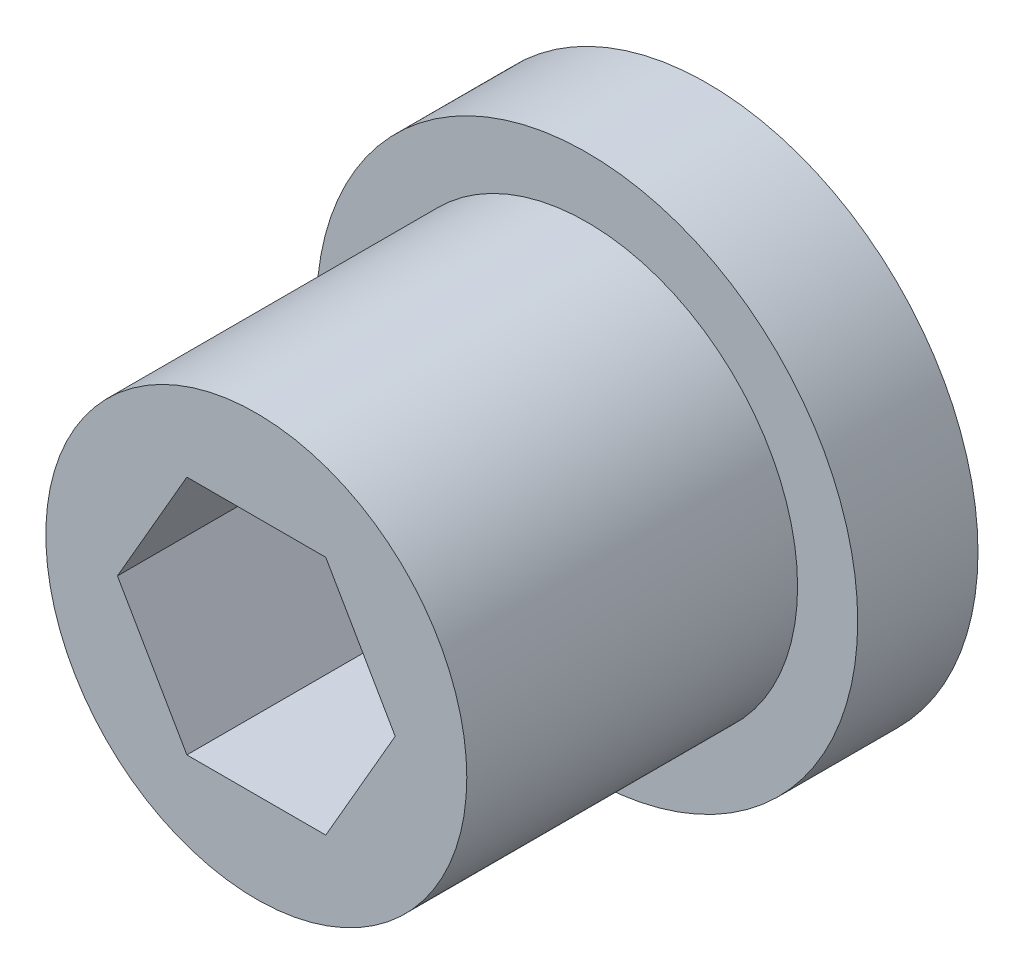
from build123d import *

# Parameters (mm, degrees)
ESQUISSE1_R             = 4.5
BASE_EXTRUSION_DEPTH    = 2
ESQUISSE2_R             = 3.5
BOSS_EXTRU_1_DEPTH      = 5.5
ENL_V_MAT_EXTRU_1_DEPTH = 10.836157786


with BuildPart() as part:
    # Esquisse1 → Base-Extrusion (new body)
    with BuildSketch(Plane.XY):
        Circle(ESQUISSE1_R)
    extrude(amount=BASE_EXTRUSION_DEPTH)

    # Esquisse2 → Boss.-Extru.1 (add)
    with BuildSketch(Plane.XY.offset(2)):
        Circle(ESQUISSE2_R)
    extrude(amount=BOSS_EXTRU_1_DEPTH)

    # Esquisse3 → Enl_v. mat.-Extru.1 (cut, through all)
    with BuildSketch(Plane.XY.offset(7.5)):
        Polygon((-1.154700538, 2), (1.154700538, 2), (2.309401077, 0), (1.154700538, -2), (-1.154700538, -2), (-2.309401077, 0), align=None)
    extrude(amount=-ENL_V_MAT_EXTRU_1_DEPTH, mode=Mode.SUBTRACT)


solid = part.part
